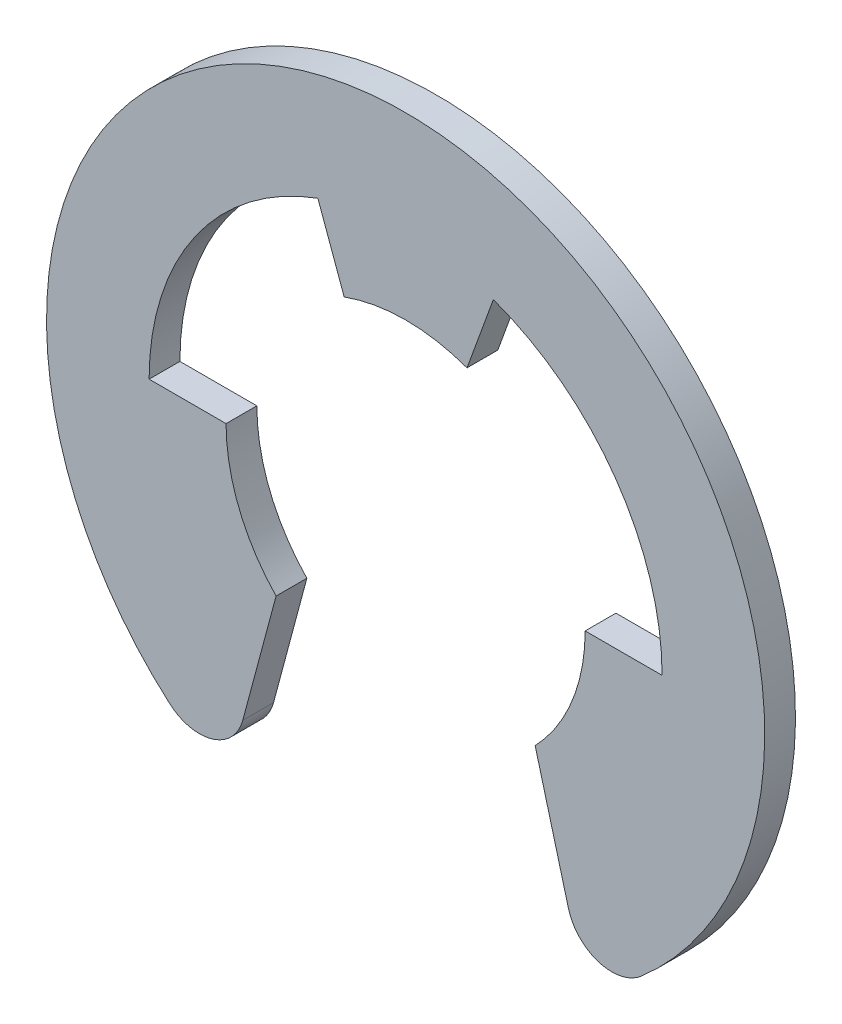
from build123d import *

# Parameters (mm, degrees)
BASE_EXTRUSION_DEPTH = 0.6


with BuildPart() as part:
    # Esquisse1 → Base-Extrusion (new body)
    with BuildSketch(Plane.XY):
        with BuildLine():
            Line((1.197070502, 3.288924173), (1.710100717, 4.698463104))
            ThreePointArc((1.710100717, 4.698463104), (4.095760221, 2.867882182), (5, 0))
            Line((5, 0), (3.5, 0))
            ThreePointArc((3.5, 0), (3.247130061, -1.306195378), (2.52505922, -2.423649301))
            Line((2.52505922, -2.423649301), (3.174612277, -4.847814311))
            ThreePointArc((3.174612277, -4.847814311), (3.764102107, -5.458154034), (4.594054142, -5.281540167))
            ThreePointArc((4.594054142, -5.281540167), (0, 7), (-4.594054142, -5.281540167))
            ThreePointArc((-4.594054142, -5.281540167), (-3.764102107, -5.458154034), (-3.174612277, -4.847814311))
            Line((-3.174612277, -4.847814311), (-2.52505922, -2.423649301))
            ThreePointArc((-2.52505922, -2.423649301), (-3.247130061, -1.306195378), (-3.5, 0))
            Line((-3.5, 0), (-5, 0))
            ThreePointArc((-5, 0), (-4.095760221, 2.867882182), (-1.710100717, 4.698463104))
            Line((-1.710100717, 4.698463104), (-1.197070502, 3.288924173))
            ThreePointArc((-1.197070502, 3.288924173), (0, 3.5), (1.197070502, 3.288924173))
        make_face()
    extrude(amount=BASE_EXTRUSION_DEPTH)


solid = part.part
